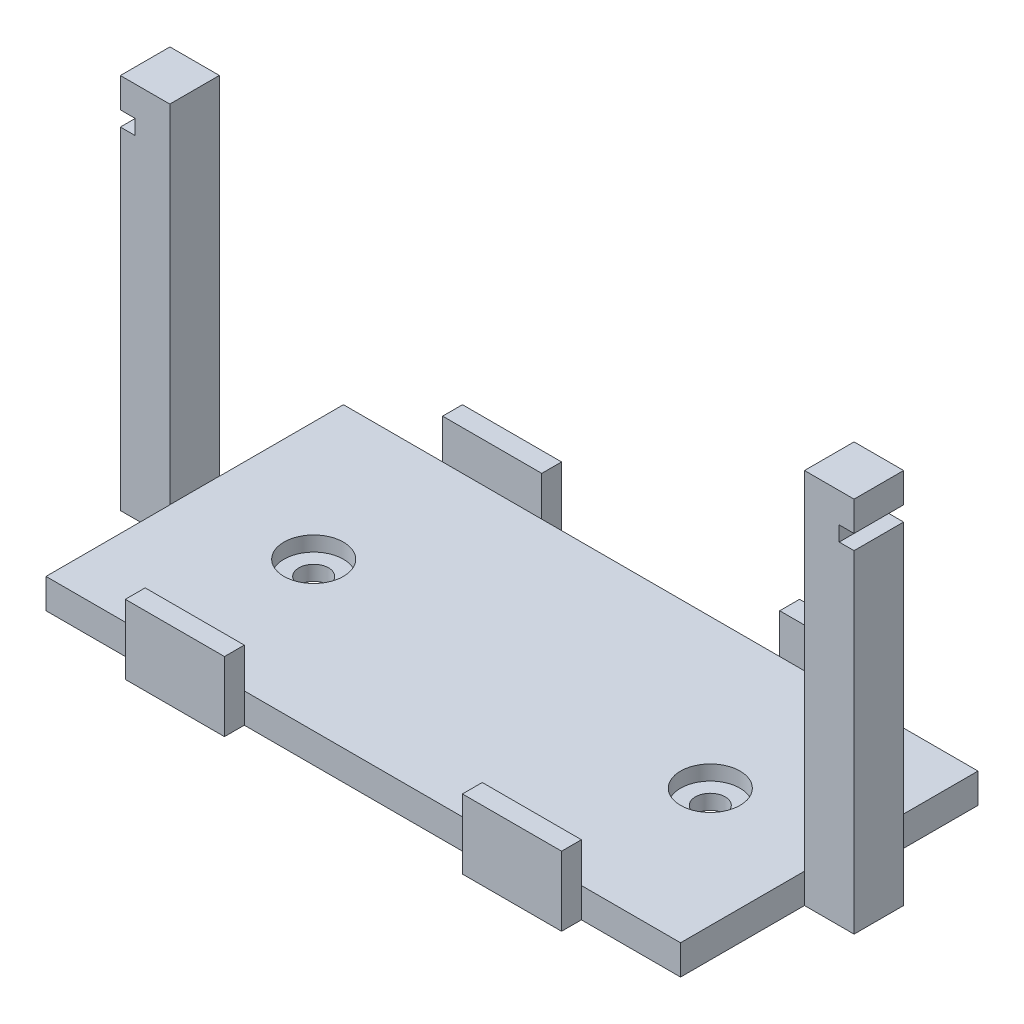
from build123d import *

# Parameters (mm, degrees)
ESBO_O1_R                = 1.5
RESSALTO_EXTRUS_O1_DEPTH = 3
ESBO_O2_W                = 10
ESBO_O2_H                = 2
RESSALTO_EXTRUS_O2_DEPTH = 4
ESBO_O3_W                = 4.986210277
ESBO_O3_H                = 5
ESBO_O3_W_2              = 5
RESSALTO_EXTRUS_O3_DEPTH = 35
ESBO_O4_R                = 3
CORTE_EXTRUS_O1_DEPTH    = 1.5
ESBO_O5_W                = 5
ESBO_O5_H                = 1.5
CORTE_EXTRUS_O2_DEPTH    = 1.5
ESBO_O6_W                = 5
ESBO_O6_H                = 1.5
CORTE_EXTRUS_O3_DEPTH    = 1.5


with BuildPart() as part:
    # Esbo_o1 → Ressalto-extrus_o1 (new body)
    with BuildSketch(Plane(origin=(0, 0, 0), x_dir=(1, 0, 0), z_dir=(0, 1, 0))):
        Polygon((-14.020618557, 13.93814433), (-4.020618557, 13.93814433), (-4.020618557, 15.93814433), (5.979381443, 15.93814433), (5.979381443, 13.93814433), (29.979381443, 13.93814433), (29.979381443, 15.93814433), (39.979381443, 15.93814433), (39.979381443, 13.93814433), (49.979381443, 13.93814433), (49.979381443, 1.43814433), (54.979381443, 1.43814433), (54.979381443, -3.56185567), (49.979381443, -3.56185567), (49.979381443, -16.06185567), (39.979381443, -16.06185567), (39.979381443, -18.06185567), (29.979381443, -18.06185567), (29.979381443, -16.06185567), (5.979381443, -16.06185567), (5.979381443, -18.06185567), (-4.020618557, -18.06185567), (-4.020618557, -16.06185567), (-14.020618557, -16.06185567), (-14.020618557, -3.56185567), (-19.020618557, -3.56185567), (-19.020618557, 1.43814433), (-14.020618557, 1.43814433), align=None)
        with Locations(Location((-2.020618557, -1.06185567, 0), (0, 0, 270))):
            Circle(ESBO_O1_R, mode=Mode.SUBTRACT)
        with Locations(Location((37.979381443, -1.06185567, 0), (0, 0, 270))):
            Circle(ESBO_O1_R, mode=Mode.SUBTRACT)
    extrude(amount=RESSALTO_EXTRUS_O1_DEPTH)

    # Esbo_o2 → Ressalto-extrus_o2 (add)
    with BuildSketch(Plane(origin=(0, 3, 0), x_dir=(1, 0, 0), z_dir=(0, 1, 0))):
        with Locations((0.979381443, 14.93814433)):
            Rectangle(ESBO_O2_W, ESBO_O2_H)
        with Locations((34.979381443, 14.93814433)):
            Rectangle(ESBO_O2_W, ESBO_O2_H)
        with Locations((0.979381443, -17.06185567)):
            Rectangle(ESBO_O2_W, ESBO_O2_H)
        with Locations((34.979381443, -17.06185567)):
            Rectangle(ESBO_O2_W, ESBO_O2_H)
    extrude(amount=RESSALTO_EXTRUS_O2_DEPTH)

    # Esbo_o3 → Ressalto-extrus_o3 (add)
    with BuildSketch(Plane(origin=(0, 3, 0), x_dir=(1, 0, 0), z_dir=(0, 1, 0))):
        with Locations((-16.527513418, -1.06185567)):
            Rectangle(ESBO_O3_W, ESBO_O3_H)
        with Locations((52.479381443, -1.06185567)):
            Rectangle(ESBO_O3_W_2, ESBO_O3_H)
    extrude(amount=RESSALTO_EXTRUS_O3_DEPTH)

    # Esbo_o4 → Corte-extrus_o1 (cut)
    with BuildSketch(Plane(origin=(0, 3, 0), x_dir=(1, 0, 0), z_dir=(0, 1, 0))):
        with Locations(Location((-2.020618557, -1.06185567, 0), (0, 0, 270))):
            Circle(ESBO_O4_R)
        with Locations(Location((37.979381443, -1.06185567, 0), (0, 0, 270))):
            Circle(ESBO_O4_R)
    extrude(amount=-CORTE_EXTRUS_O1_DEPTH, mode=Mode.SUBTRACT)

    # Esbo_o5 → Corte-extrus_o2 (cut)
    with BuildSketch(Plane(origin=(54.979381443, 0, 0), x_dir=(0, 0, -1), z_dir=(1, 0, 0))):
        with Locations((-1.06185567, 34.25)):
            Rectangle(ESBO_O5_W, ESBO_O5_H)
    extrude(amount=-CORTE_EXTRUS_O2_DEPTH, mode=Mode.SUBTRACT)

    # Esbo_o6 → Corte-extrus_o3 (cut)
    with BuildSketch(Plane.ZY.offset(19.020618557)):
        with Locations((1.06185567, 34.25)):
            Rectangle(ESBO_O6_W, ESBO_O6_H)
    extrude(amount=-CORTE_EXTRUS_O3_DEPTH, mode=Mode.SUBTRACT)


solid = part.part
